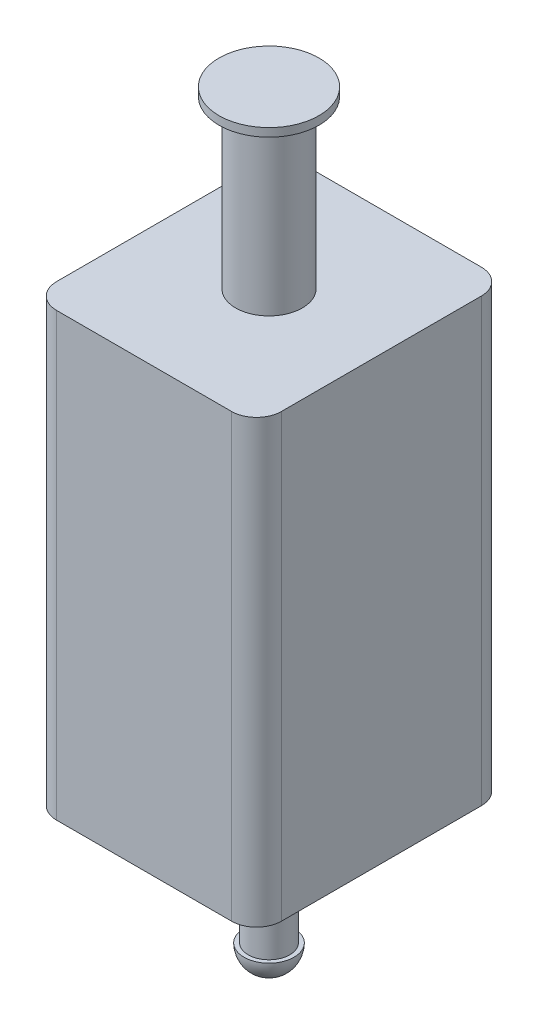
ISO-10303-21;
HEADER;
FILE_DESCRIPTION(('STEP AP214'),'2;1');
FILE_NAME('part.step','',(''),(''),'','','');
FILE_SCHEMA(('AUTOMOTIVE_DESIGN { 1 0 10303 214 1 1 1 1 }'));
ENDSEC;
DATA;
#1=APPLICATION_CONTEXT('core data for automotive mechanical design processes');
#2=APPLICATION_PROTOCOL_DEFINITION('international standard','automotive_design',2000,#1);
#3=PRODUCT_CONTEXT('',#1,'mechanical');
#4=PRODUCT('Part','Part','',(#3));
#5=PRODUCT_RELATED_PRODUCT_CATEGORY('part','',(#4));
#6=PRODUCT_DEFINITION_FORMATION('','',#4);
#7=PRODUCT_DEFINITION_CONTEXT('part definition',#1,'design');
#8=PRODUCT_DEFINITION('design','',#6,#7);
#9=PRODUCT_DEFINITION_SHAPE('','',#8);
#10=(LENGTH_UNIT() NAMED_UNIT(*) SI_UNIT(.MILLI.,.METRE.));
#11=(NAMED_UNIT(*) PLANE_ANGLE_UNIT() SI_UNIT($,.RADIAN.));
#12=(NAMED_UNIT(*) SI_UNIT($,.STERADIAN.) SOLID_ANGLE_UNIT());
#13=UNCERTAINTY_MEASURE_WITH_UNIT(LENGTH_MEASURE(1.E-05),#10,'distance_accuracy_value','');
#14=(GEOMETRIC_REPRESENTATION_CONTEXT(3) GLOBAL_UNCERTAINTY_ASSIGNED_CONTEXT((#13)) GLOBAL_UNIT_ASSIGNED_CONTEXT((#10,
#11,#12)) REPRESENTATION_CONTEXT('',''));
#15=CARTESIAN_POINT('',(0.,0.,0.));
#16=DIRECTION('',(0.,0.,1.));
#17=DIRECTION('',(1.,0.,0.));
#18=AXIS2_PLACEMENT_3D('',#15,#16,#17);
#19=CARTESIAN_POINT('',(13.5,-26.5,30.));
#20=DIRECTION('',(-1.,0.,0.));
#21=DIRECTION('',(0.,0.,1.));
#22=AXIS2_PLACEMENT_3D('',#19,#20,#21);
#23=PLANE('',#22);
#24=DIRECTION('',(0.,0.,-1.));
#25=VECTOR('',#24,1.);
#26=CARTESIAN_POINT('',(13.5,-26.5,30.));
#27=LINE('',#26,#25);
#28=CARTESIAN_POINT('',(13.5,-26.5,27.));
#29=VERTEX_POINT('',#28);
#30=CARTESIAN_POINT('',(13.5,-26.5,3.));
#31=VERTEX_POINT('',#30);
#32=EDGE_CURVE('E312',#29,#31,#27,.T.);
#33=ORIENTED_EDGE('',*,*,#32,.T.);
#34=DIRECTION('',(0.,1.,0.));
#35=VECTOR('',#34,1.);
#36=CARTESIAN_POINT('',(13.5,26.5,3.));
#37=LINE('',#36,#35);
#38=CARTESIAN_POINT('',(13.5,26.5,3.));
#39=VERTEX_POINT('',#38);
#40=EDGE_CURVE('E284',#31,#39,#37,.T.);
#41=ORIENTED_EDGE('',*,*,#40,.T.);
#42=DIRECTION('',(0.,0.,-1.));
#43=VECTOR('',#42,1.);
#44=CARTESIAN_POINT('',(13.5,26.5,30.));
#45=LINE('',#44,#43);
#46=CARTESIAN_POINT('',(13.5,26.5,27.));
#47=VERTEX_POINT('',#46);
#48=EDGE_CURVE('E160',#47,#39,#45,.T.);
#49=ORIENTED_EDGE('',*,*,#48,.F.);
#50=DIRECTION('',(0.,1.,0.));
#51=VECTOR('',#50,1.);
#52=CARTESIAN_POINT('',(13.5,-26.5,27.));
#53=LINE('',#52,#51);
#54=EDGE_CURVE('E285',#47,#29,#53,.F.);
#55=ORIENTED_EDGE('',*,*,#54,.T.);
#56=EDGE_LOOP('',(#33,#41,#49,#55));
#57=FACE_BOUND('',#56,.T.);
#58=ADVANCED_FACE('F39',(#57),#23,.F.);
#59=CARTESIAN_POINT('',(-13.5,26.5,30.));
#60=DIRECTION('',(0.,-1.,0.));
#61=DIRECTION('',(0.,0.,-1.));
#62=AXIS2_PLACEMENT_3D('',#59,#60,#61);
#63=PLANE('',#62);
#64=CARTESIAN_POINT('',(0.,26.5,15.));
#65=DIRECTION('',(0.,1.,0.));
#66=DIRECTION('',(0.,0.,1.));
#67=AXIS2_PLACEMENT_3D('',#64,#65,#66);
#68=CIRCLE('',#67,4.);
#69=CARTESIAN_POINT('',(0.,26.5,19.));
#70=VERTEX_POINT('',#69);
#71=EDGE_CURVE('E11',#70,#70,#68,.T.);
#72=ORIENTED_EDGE('',*,*,#71,.F.);
#73=EDGE_LOOP('',(#72));
#74=FACE_BOUND('',#73,.T.);
#75=DIRECTION('',(-1.,0.,0.));
#76=VECTOR('',#75,1.);
#77=CARTESIAN_POINT('',(-13.5,26.5,0.));
#78=LINE('',#77,#76);
#79=CARTESIAN_POINT('',(10.5,26.5,0.));
#80=VERTEX_POINT('',#79);
#81=CARTESIAN_POINT('',(-10.5,26.5,0.));
#82=VERTEX_POINT('',#81);
#83=EDGE_CURVE('E307',#80,#82,#78,.T.);
#84=ORIENTED_EDGE('',*,*,#83,.T.);
#85=CARTESIAN_POINT('',(-10.5,26.5,3.));
#86=DIRECTION('',(0.,-1.,0.));
#87=DIRECTION('',(0.,0.,-1.));
#88=AXIS2_PLACEMENT_3D('',#85,#86,#87);
#89=CIRCLE('',#88,3.);
#90=CARTESIAN_POINT('',(-13.5,26.5,3.));
#91=VERTEX_POINT('',#90);
#92=EDGE_CURVE('E287',#82,#91,#89,.F.);
#93=ORIENTED_EDGE('',*,*,#92,.T.);
#94=DIRECTION('',(0.,0.,-1.));
#95=VECTOR('',#94,1.);
#96=CARTESIAN_POINT('',(-13.5,26.5,30.));
#97=LINE('',#96,#95);
#98=CARTESIAN_POINT('',(-13.5,26.5,27.));
#99=VERTEX_POINT('',#98);
#100=EDGE_CURVE('E148',#99,#91,#97,.T.);
#101=ORIENTED_EDGE('',*,*,#100,.F.);
#102=CARTESIAN_POINT('',(-10.5,26.5,27.));
#103=DIRECTION('',(0.,-1.,0.));
#104=DIRECTION('',(0.,0.,-1.));
#105=AXIS2_PLACEMENT_3D('',#102,#103,#104);
#106=CIRCLE('',#105,3.);
#107=CARTESIAN_POINT('',(-10.5,26.5,30.));
#108=VERTEX_POINT('',#107);
#109=EDGE_CURVE('E144',#99,#108,#106,.F.);
#110=ORIENTED_EDGE('',*,*,#109,.T.);
#111=DIRECTION('',(-1.,0.,0.));
#112=VECTOR('',#111,1.);
#113=CARTESIAN_POINT('',(-13.5,26.5,30.));
#114=LINE('',#113,#112);
#115=CARTESIAN_POINT('',(10.5,26.5,30.));
#116=VERTEX_POINT('',#115);
#117=EDGE_CURVE('E131',#116,#108,#114,.T.);
#118=ORIENTED_EDGE('',*,*,#117,.F.);
#119=CARTESIAN_POINT('',(10.5,26.5,27.));
#120=DIRECTION('',(0.,-1.,0.));
#121=DIRECTION('',(0.,0.,-1.));
#122=AXIS2_PLACEMENT_3D('',#119,#120,#121);
#123=CIRCLE('',#122,3.);
#124=EDGE_CURVE('E63',#116,#47,#123,.F.);
#125=ORIENTED_EDGE('',*,*,#124,.T.);
#126=ORIENTED_EDGE('',*,*,#48,.T.);
#127=CARTESIAN_POINT('',(10.5,26.5,3.));
#128=DIRECTION('',(0.,-1.,0.));
#129=DIRECTION('',(0.,0.,-1.));
#130=AXIS2_PLACEMENT_3D('',#127,#128,#129);
#131=CIRCLE('',#130,3.);
#132=EDGE_CURVE('E55',#39,#80,#131,.F.);
#133=ORIENTED_EDGE('',*,*,#132,.T.);
#134=EDGE_LOOP('',(#84,#93,#101,#110,#118,#125,#126,#133));
#135=FACE_BOUND('',#134,.T.);
#136=ADVANCED_FACE('F146',(#74,#135),#63,.F.);
#137=CARTESIAN_POINT('',(-13.5,-26.5,30.));
#138=DIRECTION('',(1.,0.,0.));
#139=DIRECTION('',(0.,0.,-1.));
#140=AXIS2_PLACEMENT_3D('',#137,#138,#139);
#141=PLANE('',#140);
#142=ORIENTED_EDGE('',*,*,#100,.T.);
#143=DIRECTION('',(0.,-1.,0.));
#144=VECTOR('',#143,1.);
#145=CARTESIAN_POINT('',(-13.5,-26.5,3.));
#146=LINE('',#145,#144);
#147=CARTESIAN_POINT('',(-13.5,-26.5,3.));
#148=VERTEX_POINT('',#147);
#149=EDGE_CURVE('E151',#91,#148,#146,.T.);
#150=ORIENTED_EDGE('',*,*,#149,.T.);
#151=DIRECTION('',(0.,0.,-1.));
#152=VECTOR('',#151,1.);
#153=CARTESIAN_POINT('',(-13.5,-26.5,30.));
#154=LINE('',#153,#152);
#155=CARTESIAN_POINT('',(-13.5,-26.5,27.));
#156=VERTEX_POINT('',#155);
#157=EDGE_CURVE('E310',#156,#148,#154,.T.);
#158=ORIENTED_EDGE('',*,*,#157,.F.);
#159=DIRECTION('',(0.,-1.,0.));
#160=VECTOR('',#159,1.);
#161=CARTESIAN_POINT('',(-13.5,-26.5,27.));
#162=LINE('',#161,#160);
#163=EDGE_CURVE('E152',#156,#99,#162,.F.);
#164=ORIENTED_EDGE('',*,*,#163,.T.);
#165=EDGE_LOOP('',(#142,#150,#158,#164));
#166=FACE_BOUND('',#165,.T.);
#167=ADVANCED_FACE('F220',(#166),#141,.F.);
#168=CARTESIAN_POINT('',(-13.5,-26.5,30.));
#169=DIRECTION('',(0.,1.,0.));
#170=DIRECTION('',(0.,0.,1.));
#171=AXIS2_PLACEMENT_3D('',#168,#169,#170);
#172=PLANE('',#171);
#173=CARTESIAN_POINT('',(0.,-26.5,15.));
#174=DIRECTION('',(0.,1.,0.));
#175=DIRECTION('',(0.,0.,1.));
#176=AXIS2_PLACEMENT_3D('',#173,#174,#175);
#177=CIRCLE('',#176,2.5);
#178=CARTESIAN_POINT('',(0.,-26.5,17.5));
#179=VERTEX_POINT('',#178);
#180=EDGE_CURVE('E156',#179,#179,#177,.F.);
#181=ORIENTED_EDGE('',*,*,#180,.F.);
#182=EDGE_LOOP('',(#181));
#183=FACE_BOUND('',#182,.T.);
#184=ORIENTED_EDGE('',*,*,#157,.T.);
#185=CARTESIAN_POINT('',(-10.5,-26.5,3.));
#186=DIRECTION('',(0.,1.,0.));
#187=DIRECTION('',(0.,0.,1.));
#188=AXIS2_PLACEMENT_3D('',#185,#186,#187);
#189=CIRCLE('',#188,3.);
#190=CARTESIAN_POINT('',(-10.5,-26.5,0.));
#191=VERTEX_POINT('',#190);
#192=EDGE_CURVE('E171',#148,#191,#189,.F.);
#193=ORIENTED_EDGE('',*,*,#192,.T.);
#194=DIRECTION('',(1.,0.,0.));
#195=VECTOR('',#194,1.);
#196=CARTESIAN_POINT('',(-13.5,-26.5,0.));
#197=LINE('',#196,#195);
#198=CARTESIAN_POINT('',(10.5,-26.5,0.));
#199=VERTEX_POINT('',#198);
#200=EDGE_CURVE('E140',#191,#199,#197,.T.);
#201=ORIENTED_EDGE('',*,*,#200,.T.);
#202=CARTESIAN_POINT('',(10.5,-26.5,3.));
#203=DIRECTION('',(0.,1.,0.));
#204=DIRECTION('',(0.,0.,1.));
#205=AXIS2_PLACEMENT_3D('',#202,#203,#204);
#206=CIRCLE('',#205,3.);
#207=EDGE_CURVE('E169',#199,#31,#206,.F.);
#208=ORIENTED_EDGE('',*,*,#207,.T.);
#209=ORIENTED_EDGE('',*,*,#32,.F.);
#210=CARTESIAN_POINT('',(10.5,-26.5,27.));
#211=DIRECTION('',(0.,1.,0.));
#212=DIRECTION('',(0.,0.,1.));
#213=AXIS2_PLACEMENT_3D('',#210,#211,#212);
#214=CIRCLE('',#213,3.);
#215=CARTESIAN_POINT('',(10.5,-26.5,30.));
#216=VERTEX_POINT('',#215);
#217=EDGE_CURVE('E167',#29,#216,#214,.F.);
#218=ORIENTED_EDGE('',*,*,#217,.T.);
#219=DIRECTION('',(1.,0.,0.));
#220=VECTOR('',#219,1.);
#221=CARTESIAN_POINT('',(-13.5,-26.5,30.));
#222=LINE('',#221,#220);
#223=CARTESIAN_POINT('',(-10.5,-26.5,30.));
#224=VERTEX_POINT('',#223);
#225=EDGE_CURVE('E139',#224,#216,#222,.T.);
#226=ORIENTED_EDGE('',*,*,#225,.F.);
#227=CARTESIAN_POINT('',(-10.5,-26.5,27.));
#228=DIRECTION('',(0.,1.,0.));
#229=DIRECTION('',(0.,0.,1.));
#230=AXIS2_PLACEMENT_3D('',#227,#228,#229);
#231=CIRCLE('',#230,3.);
#232=EDGE_CURVE('E155',#224,#156,#231,.F.);
#233=ORIENTED_EDGE('',*,*,#232,.T.);
#234=EDGE_LOOP('',(#184,#193,#201,#208,#209,#218,#226,#233));
#235=FACE_BOUND('',#234,.T.);
#236=ADVANCED_FACE('F214',(#183,#235),#172,.F.);
#237=CARTESIAN_POINT('',(0.,0.,30.));
#238=DIRECTION('',(0.,0.,-1.));
#239=DIRECTION('',(-1.,0.,0.));
#240=AXIS2_PLACEMENT_3D('',#237,#238,#239);
#241=PLANE('',#240);
#242=ORIENTED_EDGE('',*,*,#225,.T.);
#243=DIRECTION('',(0.,1.,0.));
#244=VECTOR('',#243,1.);
#245=CARTESIAN_POINT('',(10.5,0.,30.));
#246=LINE('',#245,#244);
#247=EDGE_CURVE('E43',#216,#116,#246,.T.);
#248=ORIENTED_EDGE('',*,*,#247,.T.);
#249=ORIENTED_EDGE('',*,*,#117,.T.);
#250=DIRECTION('',(0.,-1.,0.));
#251=VECTOR('',#250,1.);
#252=CARTESIAN_POINT('',(-10.5,0.,30.));
#253=LINE('',#252,#251);
#254=EDGE_CURVE('E136',#108,#224,#253,.T.);
#255=ORIENTED_EDGE('',*,*,#254,.T.);
#256=EDGE_LOOP('',(#242,#248,#249,#255));
#257=FACE_BOUND('',#256,.T.);
#258=ADVANCED_FACE('F134',(#257),#241,.F.);
#259=CARTESIAN_POINT('',(0.,0.,0.));
#260=DIRECTION('',(0.,0.,-1.));
#261=DIRECTION('',(-1.,0.,0.));
#262=AXIS2_PLACEMENT_3D('',#259,#260,#261);
#263=PLANE('',#262);
#264=ORIENTED_EDGE('',*,*,#200,.F.);
#265=DIRECTION('',(0.,-1.,0.));
#266=VECTOR('',#265,1.);
#267=CARTESIAN_POINT('',(-10.5,26.5,0.));
#268=LINE('',#267,#266);
#269=CARTESIAN_POINT('',(-10.5,-18.0198684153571,0.));
#270=VERTEX_POINT('',#269);
#271=EDGE_CURVE('E183',#191,#270,#268,.F.);
#272=ORIENTED_EDGE('',*,*,#271,.T.);
#273=CARTESIAN_POINT('',(-10.,-16.5,0.));
#274=DIRECTION('',(0.,0.,-1.));
#275=DIRECTION('',(-1.,0.,0.));
#276=AXIS2_PLACEMENT_3D('',#273,#274,#275);
#277=CIRCLE('',#276,1.6);
#278=CARTESIAN_POINT('',(-10.5,-14.9801315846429,0.));
#279=VERTEX_POINT('',#278);
#280=EDGE_CURVE('E321',#279,#270,#277,.T.);
#281=ORIENTED_EDGE('',*,*,#280,.F.);
#282=DIRECTION('',(0.,-1.,0.));
#283=VECTOR('',#282,1.);
#284=CARTESIAN_POINT('',(-10.5,26.5,0.));
#285=LINE('',#284,#283);
#286=CARTESIAN_POINT('',(-10.5,11.9801315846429,0.));
#287=VERTEX_POINT('',#286);
#288=EDGE_CURVE('E181',#279,#287,#285,.F.);
#289=ORIENTED_EDGE('',*,*,#288,.T.);
#290=CARTESIAN_POINT('',(-10.,13.5,0.));
#291=DIRECTION('',(0.,0.,-1.));
#292=DIRECTION('',(-1.,0.,0.));
#293=AXIS2_PLACEMENT_3D('',#290,#291,#292);
#294=CIRCLE('',#293,1.6);
#295=CARTESIAN_POINT('',(-10.5,15.0198684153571,0.));
#296=VERTEX_POINT('',#295);
#297=EDGE_CURVE('E295',#296,#287,#294,.T.);
#298=ORIENTED_EDGE('',*,*,#297,.F.);
#299=DIRECTION('',(0.,-1.,0.));
#300=VECTOR('',#299,1.);
#301=CARTESIAN_POINT('',(-10.5,26.5,0.));
#302=LINE('',#301,#300);
#303=EDGE_CURVE('E179',#296,#82,#302,.F.);
#304=ORIENTED_EDGE('',*,*,#303,.T.);
#305=ORIENTED_EDGE('',*,*,#83,.F.);
#306=DIRECTION('',(0.,1.,0.));
#307=VECTOR('',#306,1.);
#308=CARTESIAN_POINT('',(10.5,-26.5,0.));
#309=LINE('',#308,#307);
#310=CARTESIAN_POINT('',(10.5,15.0198684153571,0.));
#311=VERTEX_POINT('',#310);
#312=EDGE_CURVE('E177',#80,#311,#309,.F.);
#313=ORIENTED_EDGE('',*,*,#312,.T.);
#314=CARTESIAN_POINT('',(10.,13.5,0.));
#315=DIRECTION('',(0.,0.,-1.));
#316=DIRECTION('',(-1.,0.,0.));
#317=AXIS2_PLACEMENT_3D('',#314,#315,#316);
#318=CIRCLE('',#317,1.6);
#319=CARTESIAN_POINT('',(10.5,11.9801315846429,0.));
#320=VERTEX_POINT('',#319);
#321=EDGE_CURVE('E332',#320,#311,#318,.T.);
#322=ORIENTED_EDGE('',*,*,#321,.F.);
#323=DIRECTION('',(0.,1.,0.));
#324=VECTOR('',#323,1.);
#325=CARTESIAN_POINT('',(10.5,-26.5,0.));
#326=LINE('',#325,#324);
#327=CARTESIAN_POINT('',(10.5,-14.9801315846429,0.));
#328=VERTEX_POINT('',#327);
#329=EDGE_CURVE('E175',#320,#328,#326,.F.);
#330=ORIENTED_EDGE('',*,*,#329,.T.);
#331=CARTESIAN_POINT('',(10.,-16.5,0.));
#332=DIRECTION('',(0.,0.,-1.));
#333=DIRECTION('',(-1.,0.,0.));
#334=AXIS2_PLACEMENT_3D('',#331,#332,#333);
#335=CIRCLE('',#334,1.6);
#336=CARTESIAN_POINT('',(10.5,-18.0198684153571,0.));
#337=VERTEX_POINT('',#336);
#338=EDGE_CURVE('E324',#337,#328,#335,.T.);
#339=ORIENTED_EDGE('',*,*,#338,.F.);
#340=DIRECTION('',(0.,1.,0.));
#341=VECTOR('',#340,1.);
#342=CARTESIAN_POINT('',(10.5,-26.5,0.));
#343=LINE('',#342,#341);
#344=EDGE_CURVE('E173',#337,#199,#343,.F.);
#345=ORIENTED_EDGE('',*,*,#344,.T.);
#346=EDGE_LOOP('',(#264,#272,#281,#289,#298,#304,#305,#313,#322,#330,#339,#345));
#347=FACE_BOUND('',#346,.T.);
#348=ADVANCED_FACE('F209',(#347),#263,.T.);
#349=CARTESIAN_POINT('',(-10.,-16.5,6.));
#350=DIRECTION('',(0.,0.,-1.));
#351=DIRECTION('',(-1.,0.,0.));
#352=AXIS2_PLACEMENT_3D('',#349,#350,#351);
#353=CYLINDRICAL_SURFACE('',#352,1.6);
#354=CARTESIAN_POINT('',(-10.,-16.5,6.));
#355=DIRECTION('',(0.,0.,-1.));
#356=DIRECTION('',(-1.,0.,0.));
#357=AXIS2_PLACEMENT_3D('',#354,#355,#356);
#358=CIRCLE('',#357,1.6);
#359=CARTESIAN_POINT('',(-11.6,-16.5,6.));
#360=VERTEX_POINT('',#359);
#361=EDGE_CURVE('E319',#360,#360,#358,.T.);
#362=ORIENTED_EDGE('',*,*,#361,.F.);
#363=EDGE_LOOP('',(#362));
#364=FACE_BOUND('',#363,.T.);
#365=ORIENTED_EDGE('',*,*,#280,.T.);
#366=CARTESIAN_POINT('',(-10.5,-18.0198684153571,0.));
#367=CARTESIAN_POINT('',(-10.5413646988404,-18.00626264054,-3.87328381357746E-06));
#368=CARTESIAN_POINT('',(-10.582145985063,-17.9909719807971,0.000856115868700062));
#369=CARTESIAN_POINT('',(-10.6622553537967,-17.9571571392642,0.00412361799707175));
#370=CARTESIAN_POINT('',(-10.7015842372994,-17.9386347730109,0.00653026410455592));
#371=CARTESIAN_POINT('',(-10.8166780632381,-17.8785830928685,0.0157733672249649));
#372=CARTESIAN_POINT('',(-10.8899350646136,-17.8324416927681,0.0246363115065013));
#373=CARTESIAN_POINT('',(-11.0275743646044,-17.7294243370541,0.0459306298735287));
#374=CARTESIAN_POINT('',(-11.0919713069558,-17.6725664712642,0.0583560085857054));
#375=CARTESIAN_POINT('',(-11.2107858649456,-17.5494392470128,0.0847827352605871));
#376=CARTESIAN_POINT('',(-11.2651925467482,-17.4831597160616,0.0987857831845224));
#377=CARTESIAN_POINT('',(-11.3653954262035,-17.3389346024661,0.127031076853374));
#378=CARTESIAN_POINT('',(-11.4105765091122,-17.2605549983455,0.141246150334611));
#379=CARTESIAN_POINT('',(-11.4872246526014,-17.0969237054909,0.166798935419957));
#380=CARTESIAN_POINT('',(-11.5186962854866,-17.0116743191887,0.178137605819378));
#381=CARTESIAN_POINT('',(-11.5665876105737,-16.8374571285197,0.195887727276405));
#382=CARTESIAN_POINT('',(-11.583155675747,-16.7485354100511,0.20234764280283));
#383=CARTESIAN_POINT('',(-11.6010549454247,-16.5689590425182,0.209340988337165));
#384=CARTESIAN_POINT('',(-11.602393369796,-16.4783052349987,0.209877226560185));
#385=CARTESIAN_POINT('',(-11.5901968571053,-16.3039806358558,0.205093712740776));
#386=CARTESIAN_POINT('',(-11.5775999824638,-16.2202316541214,0.200143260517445));
#387=CARTESIAN_POINT('',(-11.5395044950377,-16.0561250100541,0.185779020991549));
#388=CARTESIAN_POINT('',(-11.5140032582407,-15.9757680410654,0.176364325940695));
#389=CARTESIAN_POINT('',(-11.4504024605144,-15.8191175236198,0.154322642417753));
#390=CARTESIAN_POINT('',(-11.4121006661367,-15.7429136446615,0.1416448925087));
#391=CARTESIAN_POINT('',(-11.3240118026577,-15.5976621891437,0.115018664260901));
#392=CARTESIAN_POINT('',(-11.2742176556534,-15.5286190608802,0.101069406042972));
#393=CARTESIAN_POINT('',(-11.1606444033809,-15.3949711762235,0.0730243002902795));
#394=CARTESIAN_POINT('',(-11.0961652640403,-15.3309491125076,0.0589781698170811));
#395=CARTESIAN_POINT('',(-10.9569741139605,-15.2145410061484,0.0341700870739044));
#396=CARTESIAN_POINT('',(-10.8822778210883,-15.1621374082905,0.0234031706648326));
#397=CARTESIAN_POINT('',(-10.7555752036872,-15.0885529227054,0.0105176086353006));
#398=CARTESIAN_POINT('',(-10.7061373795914,-15.0631811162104,0.00666341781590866));
#399=CARTESIAN_POINT('',(-10.6047867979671,-15.0176618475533,0.00139814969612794));
#400=CARTESIAN_POINT('',(-10.5528738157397,-14.9975148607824,-1.2705358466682E-05));
#401=CARTESIAN_POINT('',(-10.5,-14.9801315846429,0.));
#402=B_SPLINE_CURVE_WITH_KNOTS('',3,(#366,#367,#368,#369,#370,#371,#372,#373,#374,#375,#376,
#377,#378,#379,#380,#381,#382,#383,#384,#385,#386,#387,#388,#389,#390,#391,#392,#393,#394,#395,
#396,#397,#398,#399,#400,#401),.UNSPECIFIED.,.F.,.F.,(4,2,2,2,2,2,2,2,2,2,2,2,2,2,2,2,2,4),(0.,
0.130538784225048,0.261004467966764,0.520736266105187,0.780033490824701,1.0396128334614,
1.31305679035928,1.58640947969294,1.85700967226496,2.12748157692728,2.38079689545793,
2.63416374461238,2.89173925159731,3.1494738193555,3.42400895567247,3.69812640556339,
3.86490578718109,4.03170033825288),.UNSPECIFIED.);
#403=EDGE_CURVE('E185',#270,#279,#402,.T.);
#404=ORIENTED_EDGE('',*,*,#403,.T.);
#405=EDGE_LOOP('',(#365,#404));
#406=FACE_BOUND('',#405,.T.);
#407=ADVANCED_FACE('F203',(#364,#406),#353,.F.);
#408=CARTESIAN_POINT('',(-10.,-16.5,6.));
#409=DIRECTION('',(0.,0.,-1.));
#410=DIRECTION('',(-1.,0.,0.));
#411=AXIS2_PLACEMENT_3D('',#408,#409,#410);
#412=PLANE('',#411);
#413=ORIENTED_EDGE('',*,*,#361,.T.);
#414=EDGE_LOOP('',(#413));
#415=FACE_BOUND('',#414,.T.);
#416=ADVANCED_FACE('F208',(#415),#412,.T.);
#417=CARTESIAN_POINT('',(10.,-16.5,6.));
#418=DIRECTION('',(0.,0.,-1.));
#419=DIRECTION('',(-1.,0.,0.));
#420=AXIS2_PLACEMENT_3D('',#417,#418,#419);
#421=CYLINDRICAL_SURFACE('',#420,1.6);
#422=CARTESIAN_POINT('',(10.,-16.5,6.));
#423=DIRECTION('',(0.,0.,-1.));
#424=DIRECTION('',(-1.,0.,0.));
#425=AXIS2_PLACEMENT_3D('',#422,#423,#424);
#426=CIRCLE('',#425,1.6);
#427=CARTESIAN_POINT('',(8.4,-16.5,6.));
#428=VERTEX_POINT('',#427);
#429=EDGE_CURVE('E334',#428,#428,#426,.T.);
#430=ORIENTED_EDGE('',*,*,#429,.F.);
#431=EDGE_LOOP('',(#430));
#432=FACE_BOUND('',#431,.T.);
#433=ORIENTED_EDGE('',*,*,#338,.T.);
#434=CARTESIAN_POINT('',(10.5,-14.9801315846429,0.));
#435=CARTESIAN_POINT('',(10.5413646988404,-14.99373735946,-3.8732838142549E-06));
#436=CARTESIAN_POINT('',(10.582145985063,-15.0090280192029,0.000856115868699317));
#437=CARTESIAN_POINT('',(10.6622553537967,-15.0428428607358,0.00412361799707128));
#438=CARTESIAN_POINT('',(10.7015842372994,-15.0613652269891,0.00653026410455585));
#439=CARTESIAN_POINT('',(10.8166780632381,-15.1214169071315,0.0157733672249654));
#440=CARTESIAN_POINT('',(10.8899350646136,-15.1675583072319,0.0246363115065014));
#441=CARTESIAN_POINT('',(11.0275743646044,-15.2705756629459,0.0459306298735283));
#442=CARTESIAN_POINT('',(11.0919713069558,-15.3274335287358,0.0583560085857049));
#443=CARTESIAN_POINT('',(11.2107858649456,-15.4505607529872,0.0847827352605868));
#444=CARTESIAN_POINT('',(11.2651925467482,-15.5168402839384,0.0987857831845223));
#445=CARTESIAN_POINT('',(11.3653954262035,-15.6610653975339,0.127031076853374));
#446=CARTESIAN_POINT('',(11.4105765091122,-15.7394450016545,0.141246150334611));
#447=CARTESIAN_POINT('',(11.4872246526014,-15.9030762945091,0.166798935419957));
#448=CARTESIAN_POINT('',(11.5186962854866,-15.9883256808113,0.178137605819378));
#449=CARTESIAN_POINT('',(11.5665876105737,-16.1625428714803,0.195887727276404));
#450=CARTESIAN_POINT('',(11.583155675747,-16.2514645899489,0.202347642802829));
#451=CARTESIAN_POINT('',(11.6010549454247,-16.4310409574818,0.209340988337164));
#452=CARTESIAN_POINT('',(11.602393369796,-16.5216947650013,0.209877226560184));
#453=CARTESIAN_POINT('',(11.5901968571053,-16.6960193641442,0.205093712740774));
#454=CARTESIAN_POINT('',(11.5775999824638,-16.7797683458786,0.200143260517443));
#455=CARTESIAN_POINT('',(11.5395044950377,-16.943874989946,0.185779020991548));
#456=CARTESIAN_POINT('',(11.5140032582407,-17.0242319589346,0.176364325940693));
#457=CARTESIAN_POINT('',(11.4504024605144,-17.1808824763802,0.154322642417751));
#458=CARTESIAN_POINT('',(11.4121006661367,-17.2570863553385,0.141644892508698));
#459=CARTESIAN_POINT('',(11.3240118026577,-17.4023378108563,0.115018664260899));
#460=CARTESIAN_POINT('',(11.2742176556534,-17.4713809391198,0.10106940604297));
#461=CARTESIAN_POINT('',(11.1606444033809,-17.6050288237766,0.073024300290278));
#462=CARTESIAN_POINT('',(11.0961652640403,-17.6690508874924,0.0589781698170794));
#463=CARTESIAN_POINT('',(10.9569741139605,-17.7854589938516,0.0341700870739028));
#464=CARTESIAN_POINT('',(10.8822778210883,-17.8378625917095,0.0234031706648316));
#465=CARTESIAN_POINT('',(10.7555752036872,-17.9114470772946,0.0105176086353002));
#466=CARTESIAN_POINT('',(10.7061373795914,-17.9368188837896,0.00666341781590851));
#467=CARTESIAN_POINT('',(10.6047867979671,-17.9823381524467,0.00139814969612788));
#468=CARTESIAN_POINT('',(10.5528738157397,-18.0024851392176,-1.27053584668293E-05));
#469=CARTESIAN_POINT('',(10.5,-18.0198684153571,0.));
#470=B_SPLINE_CURVE_WITH_KNOTS('',3,(#434,#435,#436,#437,#438,#439,#440,#441,#442,#443,#444,
#445,#446,#447,#448,#449,#450,#451,#452,#453,#454,#455,#456,#457,#458,#459,#460,#461,#462,#463,
#464,#465,#466,#467,#468,#469),.UNSPECIFIED.,.F.,.F.,(4,2,2,2,2,2,2,2,2,2,2,2,2,2,2,2,2,4),(0.,
0.130538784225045,0.261004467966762,0.520736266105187,0.780033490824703,1.0396128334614,
1.31305679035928,1.58640947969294,1.85700967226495,2.12748157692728,2.38079689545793,
2.63416374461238,2.89173925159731,3.1494738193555,3.42400895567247,3.69812640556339,
3.86490578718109,4.03170033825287),.UNSPECIFIED.);
#471=EDGE_CURVE('E259',#328,#337,#470,.T.);
#472=ORIENTED_EDGE('',*,*,#471,.T.);
#473=EDGE_LOOP('',(#433,#472));
#474=FACE_BOUND('',#473,.T.);
#475=ADVANCED_FACE('F252',(#432,#474),#421,.F.);
#476=CARTESIAN_POINT('',(10.,-16.5,6.));
#477=DIRECTION('',(0.,0.,-1.));
#478=DIRECTION('',(-1.,0.,0.));
#479=AXIS2_PLACEMENT_3D('',#476,#477,#478);
#480=PLANE('',#479);
#481=ORIENTED_EDGE('',*,*,#429,.T.);
#482=EDGE_LOOP('',(#481));
#483=FACE_BOUND('',#482,.T.);
#484=ADVANCED_FACE('F256',(#483),#480,.T.);
#485=CARTESIAN_POINT('',(10.,13.5,6.));
#486=DIRECTION('',(0.,0.,-1.));
#487=DIRECTION('',(-1.,0.,0.));
#488=AXIS2_PLACEMENT_3D('',#485,#486,#487);
#489=CYLINDRICAL_SURFACE('',#488,1.6);
#490=CARTESIAN_POINT('',(10.,13.5,6.));
#491=DIRECTION('',(0.,0.,-1.));
#492=DIRECTION('',(-1.,0.,0.));
#493=AXIS2_PLACEMENT_3D('',#490,#491,#492);
#494=CIRCLE('',#493,1.6);
#495=CARTESIAN_POINT('',(8.4,13.5,6.));
#496=VERTEX_POINT('',#495);
#497=EDGE_CURVE('E301',#496,#496,#494,.T.);
#498=ORIENTED_EDGE('',*,*,#497,.F.);
#499=EDGE_LOOP('',(#498));
#500=FACE_BOUND('',#499,.T.);
#501=ORIENTED_EDGE('',*,*,#321,.T.);
#502=CARTESIAN_POINT('',(10.5,15.0198684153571,0.));
#503=CARTESIAN_POINT('',(10.5413646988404,15.00626264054,-3.87328381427E-06));
#504=CARTESIAN_POINT('',(10.582145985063,14.9909719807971,0.000856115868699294));
#505=CARTESIAN_POINT('',(10.6622553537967,14.9571571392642,0.00412361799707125));
#506=CARTESIAN_POINT('',(10.7015842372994,14.9386347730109,0.00653026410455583));
#507=CARTESIAN_POINT('',(10.8166780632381,14.8785830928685,0.0157733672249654));
#508=CARTESIAN_POINT('',(10.8899350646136,14.8324416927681,0.0246363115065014));
#509=CARTESIAN_POINT('',(11.0275743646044,14.7294243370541,0.0459306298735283));
#510=CARTESIAN_POINT('',(11.0919713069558,14.6725664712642,0.0583560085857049));
#511=CARTESIAN_POINT('',(11.2107858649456,14.5494392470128,0.0847827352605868));
#512=CARTESIAN_POINT('',(11.2651925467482,14.4831597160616,0.0987857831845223));
#513=CARTESIAN_POINT('',(11.3653954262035,14.3389346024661,0.127031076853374));
#514=CARTESIAN_POINT('',(11.4105765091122,14.2605549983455,0.141246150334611));
#515=CARTESIAN_POINT('',(11.4872246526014,14.0969237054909,0.166798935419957));
#516=CARTESIAN_POINT('',(11.5186962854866,14.0116743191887,0.178137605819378));
#517=CARTESIAN_POINT('',(11.5665876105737,13.8374571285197,0.195887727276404));
#518=CARTESIAN_POINT('',(11.583155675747,13.7485354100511,0.202347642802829));
#519=CARTESIAN_POINT('',(11.6010549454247,13.5689590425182,0.209340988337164));
#520=CARTESIAN_POINT('',(11.602393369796,13.4783052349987,0.209877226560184));
#521=CARTESIAN_POINT('',(11.5901968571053,13.3039806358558,0.205093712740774));
#522=CARTESIAN_POINT('',(11.5775999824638,13.2202316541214,0.200143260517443));
#523=CARTESIAN_POINT('',(11.5395044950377,13.056125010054,0.185779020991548));
#524=CARTESIAN_POINT('',(11.5140032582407,12.9757680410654,0.176364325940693));
#525=CARTESIAN_POINT('',(11.4504024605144,12.8191175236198,0.154322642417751));
#526=CARTESIAN_POINT('',(11.4121006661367,12.7429136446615,0.141644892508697));
#527=CARTESIAN_POINT('',(11.3240118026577,12.5976621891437,0.115018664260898));
#528=CARTESIAN_POINT('',(11.2742176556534,12.5286190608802,0.10106940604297));
#529=CARTESIAN_POINT('',(11.1606444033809,12.3949711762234,0.073024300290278));
#530=CARTESIAN_POINT('',(11.0961652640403,12.3309491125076,0.0589781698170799));
#531=CARTESIAN_POINT('',(10.9569741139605,12.2145410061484,0.0341700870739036));
#532=CARTESIAN_POINT('',(10.8822778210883,12.1621374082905,0.0234031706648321));
#533=CARTESIAN_POINT('',(10.7555752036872,12.0885529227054,0.0105176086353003));
#534=CARTESIAN_POINT('',(10.7061373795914,12.0631811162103,0.00666341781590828));
#535=CARTESIAN_POINT('',(10.6047867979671,12.0176618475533,0.00139814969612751));
#536=CARTESIAN_POINT('',(10.5528738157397,11.9975148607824,-1.27053584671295E-05));
#537=CARTESIAN_POINT('',(10.5,11.9801315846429,0.));
#538=B_SPLINE_CURVE_WITH_KNOTS('',3,(#502,#503,#504,#505,#506,#507,#508,#509,#510,#511,#512,
#513,#514,#515,#516,#517,#518,#519,#520,#521,#522,#523,#524,#525,#526,#527,#528,#529,#530,#531,
#532,#533,#534,#535,#536,#537),.UNSPECIFIED.,.F.,.F.,(4,2,2,2,2,2,2,2,2,2,2,2,2,2,2,2,2,4),(0.,
0.130538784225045,0.261004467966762,0.520736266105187,0.780033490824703,1.0396128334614,
1.31305679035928,1.58640947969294,1.85700967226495,2.12748157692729,2.38079689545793,
2.63416374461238,2.89173925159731,3.1494738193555,3.42400895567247,3.69812640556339,
3.86490578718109,4.03170033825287),.UNSPECIFIED.);
#539=EDGE_CURVE('E265',#311,#320,#538,.T.);
#540=ORIENTED_EDGE('',*,*,#539,.T.);
#541=EDGE_LOOP('',(#501,#540));
#542=FACE_BOUND('',#541,.T.);
#543=ADVANCED_FACE('F445',(#500,#542),#489,.F.);
#544=CARTESIAN_POINT('',(10.,13.5,6.));
#545=DIRECTION('',(0.,0.,-1.));
#546=DIRECTION('',(-1.,0.,0.));
#547=AXIS2_PLACEMENT_3D('',#544,#545,#546);
#548=PLANE('',#547);
#549=ORIENTED_EDGE('',*,*,#497,.T.);
#550=EDGE_LOOP('',(#549));
#551=FACE_BOUND('',#550,.T.);
#552=ADVANCED_FACE('F452',(#551),#548,.T.);
#553=CARTESIAN_POINT('',(-10.,13.5,6.));
#554=DIRECTION('',(0.,0.,-1.));
#555=DIRECTION('',(-1.,0.,0.));
#556=AXIS2_PLACEMENT_3D('',#553,#554,#555);
#557=CYLINDRICAL_SURFACE('',#556,1.6);
#558=CARTESIAN_POINT('',(-10.,13.5,6.));
#559=DIRECTION('',(0.,0.,-1.));
#560=DIRECTION('',(-1.,0.,0.));
#561=AXIS2_PLACEMENT_3D('',#558,#559,#560);
#562=CIRCLE('',#561,1.6);
#563=CARTESIAN_POINT('',(-11.6,13.5,6.));
#564=VERTEX_POINT('',#563);
#565=EDGE_CURVE('E302',#564,#564,#562,.T.);
#566=ORIENTED_EDGE('',*,*,#565,.F.);
#567=EDGE_LOOP('',(#566));
#568=FACE_BOUND('',#567,.T.);
#569=ORIENTED_EDGE('',*,*,#297,.T.);
#570=CARTESIAN_POINT('',(-10.5,11.9801315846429,0.));
#571=CARTESIAN_POINT('',(-10.5413646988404,11.99373735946,-3.8732838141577E-06));
#572=CARTESIAN_POINT('',(-10.582145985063,12.0090280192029,0.000856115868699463));
#573=CARTESIAN_POINT('',(-10.6622553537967,12.0428428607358,0.00412361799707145));
#574=CARTESIAN_POINT('',(-10.7015842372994,12.0613652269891,0.00653026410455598));
#575=CARTESIAN_POINT('',(-10.8166780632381,12.1214169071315,0.0157733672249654));
#576=CARTESIAN_POINT('',(-10.8899350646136,12.1675583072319,0.0246363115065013));
#577=CARTESIAN_POINT('',(-11.0275743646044,12.2705756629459,0.0459306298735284));
#578=CARTESIAN_POINT('',(-11.0919713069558,12.3274335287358,0.0583560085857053));
#579=CARTESIAN_POINT('',(-11.2107858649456,12.4505607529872,0.0847827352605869));
#580=CARTESIAN_POINT('',(-11.2651925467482,12.5168402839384,0.0987857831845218));
#581=CARTESIAN_POINT('',(-11.3653954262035,12.6610653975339,0.127031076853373));
#582=CARTESIAN_POINT('',(-11.4105765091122,12.7394450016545,0.141246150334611));
#583=CARTESIAN_POINT('',(-11.4872246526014,12.9030762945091,0.166798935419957));
#584=CARTESIAN_POINT('',(-11.5186962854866,12.9883256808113,0.178137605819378));
#585=CARTESIAN_POINT('',(-11.5665876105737,13.1625428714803,0.195887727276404));
#586=CARTESIAN_POINT('',(-11.583155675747,13.2514645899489,0.20234764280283));
#587=CARTESIAN_POINT('',(-11.6010549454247,13.4310409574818,0.209340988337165));
#588=CARTESIAN_POINT('',(-11.602393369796,13.5216947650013,0.209877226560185));
#589=CARTESIAN_POINT('',(-11.5901968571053,13.6960193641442,0.205093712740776));
#590=CARTESIAN_POINT('',(-11.5775999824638,13.7797683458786,0.200143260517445));
#591=CARTESIAN_POINT('',(-11.5395044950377,13.9438749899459,0.185779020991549));
#592=CARTESIAN_POINT('',(-11.5140032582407,14.0242319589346,0.176364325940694));
#593=CARTESIAN_POINT('',(-11.4504024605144,14.1808824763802,0.154322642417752));
#594=CARTESIAN_POINT('',(-11.4121006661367,14.2570863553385,0.141644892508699));
#595=CARTESIAN_POINT('',(-11.3240118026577,14.4023378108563,0.1150186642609));
#596=CARTESIAN_POINT('',(-11.2742176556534,14.4713809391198,0.101069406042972));
#597=CARTESIAN_POINT('',(-11.1606444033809,14.6050288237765,0.0730243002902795));
#598=CARTESIAN_POINT('',(-11.0961652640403,14.6690508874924,0.058978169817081));
#599=CARTESIAN_POINT('',(-10.9569741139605,14.7854589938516,0.0341700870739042));
#600=CARTESIAN_POINT('',(-10.8822778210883,14.8378625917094,0.0234031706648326));
#601=CARTESIAN_POINT('',(-10.7555752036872,14.9114470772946,0.0105176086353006));
#602=CARTESIAN_POINT('',(-10.7061373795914,14.9368188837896,0.00666341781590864));
#603=CARTESIAN_POINT('',(-10.6047867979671,14.9823381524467,0.00139814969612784));
#604=CARTESIAN_POINT('',(-10.5528738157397,15.0024851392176,-1.27053584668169E-05));
#605=CARTESIAN_POINT('',(-10.5,15.0198684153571,0.));
#606=B_SPLINE_CURVE_WITH_KNOTS('',3,(#570,#571,#572,#573,#574,#575,#576,#577,#578,#579,#580,
#581,#582,#583,#584,#585,#586,#587,#588,#589,#590,#591,#592,#593,#594,#595,#596,#597,#598,#599,
#600,#601,#602,#603,#604,#605),.UNSPECIFIED.,.F.,.F.,(4,2,2,2,2,2,2,2,2,2,2,2,2,2,2,2,2,4),(0.,
0.130538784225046,0.261004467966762,0.520736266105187,0.780033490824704,1.0396128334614,
1.31305679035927,1.58640947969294,1.85700967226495,2.12748157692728,2.38079689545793,
2.63416374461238,2.89173925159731,3.1494738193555,3.42400895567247,3.69812640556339,
3.86490578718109,4.03170033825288),.UNSPECIFIED.);
#607=EDGE_CURVE('E193',#287,#296,#606,.T.);
#608=ORIENTED_EDGE('',*,*,#607,.T.);
#609=EDGE_LOOP('',(#569,#608));
#610=FACE_BOUND('',#609,.T.);
#611=ADVANCED_FACE('F244',(#568,#610),#557,.F.);
#612=CARTESIAN_POINT('',(-10.,13.5,6.));
#613=DIRECTION('',(0.,0.,-1.));
#614=DIRECTION('',(-1.,0.,0.));
#615=AXIS2_PLACEMENT_3D('',#612,#613,#614);
#616=PLANE('',#615);
#617=ORIENTED_EDGE('',*,*,#565,.T.);
#618=EDGE_LOOP('',(#617));
#619=FACE_BOUND('',#618,.T.);
#620=ADVANCED_FACE('F238',(#619),#616,.T.);
#621=CARTESIAN_POINT('',(0.,-41.5,15.));
#622=DIRECTION('',(0.,1.,0.));
#623=DIRECTION('',(0.,0.,1.));
#624=AXIS2_PLACEMENT_3D('',#621,#622,#623);
#625=CYLINDRICAL_SURFACE('',#624,2.5);
#626=CARTESIAN_POINT('',(0.,-41.5,15.));
#627=DIRECTION('',(0.,-1.,0.));
#628=DIRECTION('',(0.,0.,-1.));
#629=AXIS2_PLACEMENT_3D('',#626,#627,#628);
#630=CIRCLE('',#629,2.5);
#631=CARTESIAN_POINT('',(0.,-41.5,12.5));
#632=VERTEX_POINT('',#631);
#633=EDGE_CURVE('E328',#632,#632,#630,.T.);
#634=ORIENTED_EDGE('',*,*,#633,.F.);
#635=EDGE_LOOP('',(#634));
#636=FACE_BOUND('',#635,.T.);
#637=ORIENTED_EDGE('',*,*,#180,.T.);
#638=EDGE_LOOP('',(#637));
#639=FACE_BOUND('',#638,.T.);
#640=ADVANCED_FACE('F231',(#636,#639),#625,.T.);
#641=CARTESIAN_POINT('',(-10.5,0.,27.));
#642=DIRECTION('',(0.,-1.,0.));
#643=DIRECTION('',(0.,0.,-1.));
#644=AXIS2_PLACEMENT_3D('',#641,#642,#643);
#645=CYLINDRICAL_SURFACE('',#644,3.);
#646=ORIENTED_EDGE('',*,*,#109,.F.);
#647=ORIENTED_EDGE('',*,*,#163,.F.);
#648=ORIENTED_EDGE('',*,*,#232,.F.);
#649=ORIENTED_EDGE('',*,*,#254,.F.);
#650=EDGE_LOOP('',(#646,#647,#648,#649));
#651=FACE_BOUND('',#650,.T.);
#652=ADVANCED_FACE('F154',(#651),#645,.T.);
#653=CARTESIAN_POINT('',(-10.5,-26.5,3.));
#654=DIRECTION('',(0.,1.,0.));
#655=DIRECTION('',(0.,0.,1.));
#656=AXIS2_PLACEMENT_3D('',#653,#654,#655);
#657=CYLINDRICAL_SURFACE('',#656,3.);
#658=ORIENTED_EDGE('',*,*,#403,.F.);
#659=ORIENTED_EDGE('',*,*,#271,.F.);
#660=ORIENTED_EDGE('',*,*,#192,.F.);
#661=ORIENTED_EDGE('',*,*,#149,.F.);
#662=ORIENTED_EDGE('',*,*,#92,.F.);
#663=ORIENTED_EDGE('',*,*,#303,.F.);
#664=ORIENTED_EDGE('',*,*,#607,.F.);
#665=ORIENTED_EDGE('',*,*,#288,.F.);
#666=EDGE_LOOP('',(#658,#659,#660,#661,#662,#663,#664,#665));
#667=FACE_BOUND('',#666,.T.);
#668=ADVANCED_FACE('F200',(#667),#657,.T.);
#669=CARTESIAN_POINT('',(10.5,-26.5,3.));
#670=DIRECTION('',(0.,-1.,0.));
#671=DIRECTION('',(0.,0.,-1.));
#672=AXIS2_PLACEMENT_3D('',#669,#670,#671);
#673=CYLINDRICAL_SURFACE('',#672,3.);
#674=ORIENTED_EDGE('',*,*,#539,.F.);
#675=ORIENTED_EDGE('',*,*,#312,.F.);
#676=ORIENTED_EDGE('',*,*,#132,.F.);
#677=ORIENTED_EDGE('',*,*,#40,.F.);
#678=ORIENTED_EDGE('',*,*,#207,.F.);
#679=ORIENTED_EDGE('',*,*,#344,.F.);
#680=ORIENTED_EDGE('',*,*,#471,.F.);
#681=ORIENTED_EDGE('',*,*,#329,.F.);
#682=EDGE_LOOP('',(#674,#675,#676,#677,#678,#679,#680,#681));
#683=FACE_BOUND('',#682,.T.);
#684=ADVANCED_FACE('F236',(#683),#673,.T.);
#685=CARTESIAN_POINT('',(10.5,0.,27.));
#686=DIRECTION('',(0.,1.,0.));
#687=DIRECTION('',(0.,0.,1.));
#688=AXIS2_PLACEMENT_3D('',#685,#686,#687);
#689=CYLINDRICAL_SURFACE('',#688,3.);
#690=ORIENTED_EDGE('',*,*,#217,.F.);
#691=ORIENTED_EDGE('',*,*,#54,.F.);
#692=ORIENTED_EDGE('',*,*,#124,.F.);
#693=ORIENTED_EDGE('',*,*,#247,.F.);
#694=EDGE_LOOP('',(#690,#691,#692,#693));
#695=FACE_BOUND('',#694,.T.);
#696=ADVANCED_FACE('F41',(#695),#689,.T.);
#697=CARTESIAN_POINT('',(0.,46.5,15.));
#698=DIRECTION('',(0.,-1.,0.));
#699=DIRECTION('',(0.,0.,-1.));
#700=AXIS2_PLACEMENT_3D('',#697,#698,#699);
#701=CYLINDRICAL_SURFACE('',#700,4.);
#702=CARTESIAN_POINT('',(0.,46.5,15.));
#703=DIRECTION('',(0.,1.,0.));
#704=DIRECTION('',(0.,0.,1.));
#705=AXIS2_PLACEMENT_3D('',#702,#703,#704);
#706=CIRCLE('',#705,4.);
#707=CARTESIAN_POINT('',(0.,46.5,19.));
#708=VERTEX_POINT('',#707);
#709=EDGE_CURVE('E340',#708,#708,#706,.T.);
#710=ORIENTED_EDGE('',*,*,#709,.F.);
#711=EDGE_LOOP('',(#710));
#712=FACE_BOUND('',#711,.T.);
#713=ORIENTED_EDGE('',*,*,#71,.T.);
#714=EDGE_LOOP('',(#713));
#715=FACE_BOUND('',#714,.T.);
#716=ADVANCED_FACE('F250',(#712,#715),#701,.T.);
#717=CARTESIAN_POINT('',(0.,47.5,15.));
#718=DIRECTION('',(0.,-1.,0.));
#719=DIRECTION('',(0.,0.,-1.));
#720=AXIS2_PLACEMENT_3D('',#717,#718,#719);
#721=CYLINDRICAL_SURFACE('',#720,6.);
#722=CARTESIAN_POINT('',(0.,47.5,15.));
#723=DIRECTION('',(0.,1.,0.));
#724=DIRECTION('',(0.,0.,1.));
#725=AXIS2_PLACEMENT_3D('',#722,#723,#724);
#726=CIRCLE('',#725,6.);
#727=CARTESIAN_POINT('',(0.,47.5,21.));
#728=VERTEX_POINT('',#727);
#729=EDGE_CURVE('E344',#728,#728,#726,.T.);
#730=ORIENTED_EDGE('',*,*,#729,.F.);
#731=EDGE_LOOP('',(#730));
#732=FACE_BOUND('',#731,.T.);
#733=CARTESIAN_POINT('',(0.,46.5,15.));
#734=DIRECTION('',(0.,1.,0.));
#735=DIRECTION('',(0.,0.,1.));
#736=AXIS2_PLACEMENT_3D('',#733,#734,#735);
#737=CIRCLE('',#736,6.);
#738=CARTESIAN_POINT('',(0.,46.5,21.));
#739=VERTEX_POINT('',#738);
#740=EDGE_CURVE('E345',#739,#739,#737,.T.);
#741=ORIENTED_EDGE('',*,*,#740,.T.);
#742=EDGE_LOOP('',(#741));
#743=FACE_BOUND('',#742,.T.);
#744=ADVANCED_FACE('F369',(#732,#743),#721,.T.);
#745=CARTESIAN_POINT('',(0.,47.5,15.));
#746=DIRECTION('',(0.,1.,0.));
#747=DIRECTION('',(0.,0.,1.));
#748=AXIS2_PLACEMENT_3D('',#745,#746,#747);
#749=PLANE('',#748);
#750=ORIENTED_EDGE('',*,*,#729,.T.);
#751=EDGE_LOOP('',(#750));
#752=FACE_BOUND('',#751,.T.);
#753=ADVANCED_FACE('F366',(#752),#749,.T.);
#754=CARTESIAN_POINT('',(0.,46.5,15.));
#755=DIRECTION('',(0.,1.,0.));
#756=DIRECTION('',(0.,0.,1.));
#757=AXIS2_PLACEMENT_3D('',#754,#755,#756);
#758=PLANE('',#757);
#759=ORIENTED_EDGE('',*,*,#709,.T.);
#760=EDGE_LOOP('',(#759));
#761=FACE_BOUND('',#760,.T.);
#762=ORIENTED_EDGE('',*,*,#740,.F.);
#763=EDGE_LOOP('',(#762));
#764=FACE_BOUND('',#763,.T.);
#765=ADVANCED_FACE('F362',(#761,#764),#758,.F.);
#766=CARTESIAN_POINT('',(0.,-41.5,15.));
#767=DIRECTION('',(0.,-1.,0.));
#768=DIRECTION('',(0.,0.,-1.));
#769=AXIS2_PLACEMENT_3D('',#766,#767,#768);
#770=PLANE('',#769);
#771=ORIENTED_EDGE('',*,*,#633,.T.);
#772=EDGE_LOOP('',(#771));
#773=FACE_BOUND('',#772,.T.);
#774=CARTESIAN_POINT('',(0.,-41.5,15.));
#775=DIRECTION('',(0.,1.,0.));
#776=DIRECTION('',(0.,0.,1.));
#777=AXIS2_PLACEMENT_3D('',#774,#775,#776);
#778=CIRCLE('',#777,3.);
#779=CARTESIAN_POINT('',(0.,-41.5,18.));
#780=VERTEX_POINT('',#779);
#781=EDGE_CURVE('E348',#780,#780,#778,.T.);
#782=ORIENTED_EDGE('',*,*,#781,.T.);
#783=EDGE_LOOP('',(#782));
#784=FACE_BOUND('',#783,.T.);
#785=ADVANCED_FACE('F354',(#773,#784),#770,.F.);
#786=CARTESIAN_POINT('',(0.,-41.5,15.));
#787=DIRECTION('',(0.,1.,0.));
#788=DIRECTION('',(0.,0.,-1.));
#789=AXIS2_PLACEMENT_3D('',#786,#787,#788);
#790=SPHERICAL_SURFACE('',#789,3.);
#791=ORIENTED_EDGE('',*,*,#781,.F.);
#792=EDGE_LOOP('',(#791));
#793=FACE_BOUND('',#792,.T.);
#794=ADVANCED_FACE('F356',(#793),#790,.T.);
#795=CLOSED_SHELL('',(#58,#136,#167,#236,#258,#348,#407,#416,#475,#484,#543,#552,#611,#620,#640,
#652,#668,#684,#696,#716,#744,#753,#765,#785,#794));
#796=MANIFOLD_SOLID_BREP('B2',#795);
#797=ADVANCED_BREP_SHAPE_REPRESENTATION('',(#18,#796),#14);
#798=SHAPE_DEFINITION_REPRESENTATION(#9,#797);
ENDSEC;
END-ISO-10303-21;
